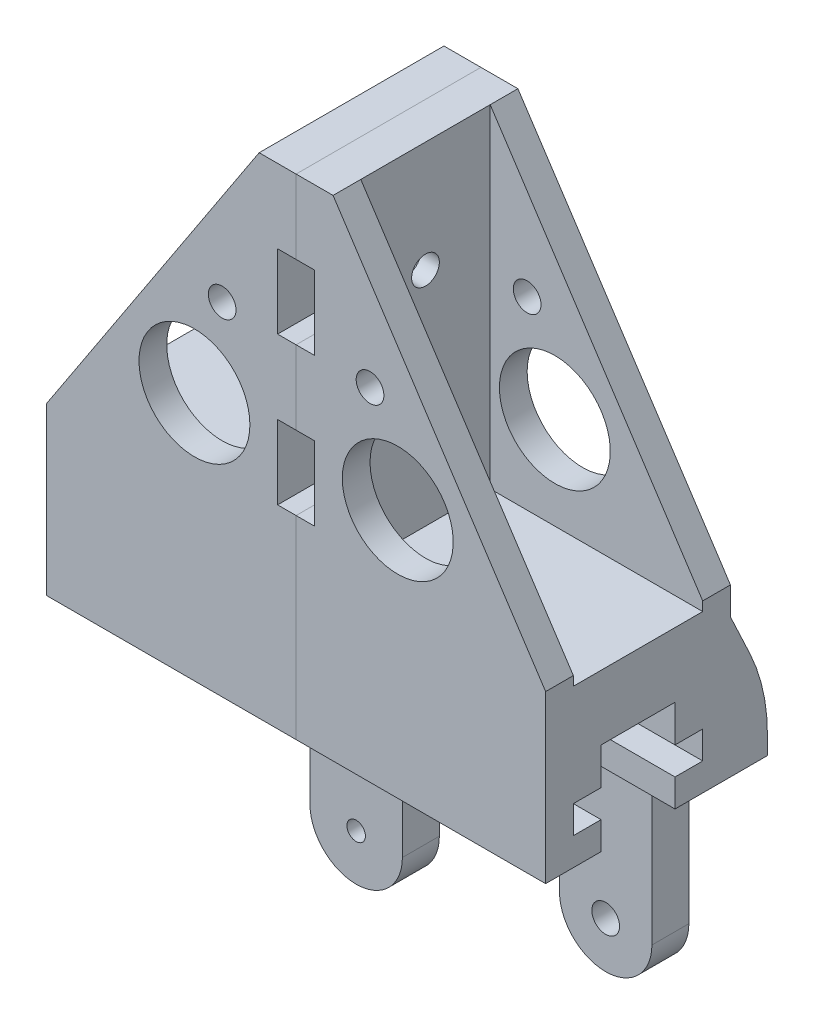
from build123d import *

# Parameters (mm, degrees)
EXTRUDE_1_DEPTH     = 10
SHELL_1_T           = -3
CUT_EXTRUDE_1_DEPTH = 7
SKETCH_3_W          = 2
SKETCH_3_H          = 8
SKETCH_3_H_2        = 6
EXTRUDE_2_DEPTH     = 10
SKETCH_4_R          = 6
SKETCH_4_R_2        = 1.5
CUT_EXTRUDE_2_DEPTH = 20
SKETCH_5_R          = 1.5
CUT_EXTRUDE_3_DEPTH = 20
EXTRUDE_3_DEPTH     = 27
SKETCH_7_R          = 1.5
EXTRUDE_4_DEPTH     = 4
EXTRUDE_5_DEPTH     = 4
SKETCH_9_R          = 1.5
EXTRUDE_6_DEPTH     = 4
SKETCH_10_R         = 1
CUT_EXTRUDE_4_DEPTH = 4


with BuildPart() as part:
    # Sketch 1 → Extrude 1 (new, symmetric)
    with BuildSketch(Plane.XY):
        Polygon((0, 0), (2, 0), (25, -35), (25, -38), (0, -38), align=None)
    extrude(amount=EXTRUDE_1_DEPTH, both=True)

    # Shell 1
    shell_1_openings = [part.faces().sort_by_distance(p)[0] for p in [
        (13.5, -17.5, 0),
    ]]
    offset(amount=SHELL_1_T, openings=shell_1_openings, kind=Kind.INTERSECTION)

    # Sketch 2 → Cut-Extrude 1 (cut, symmetric)
    with BuildSketch(Plane.XY):
        Polygon((2, 0), (2, -36), (25, -36), (25, -35), (22, -30.434782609), (22, -35), (3, -35), (3, -3), (3.971428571, -3), align=None)
    extrude(amount=CUT_EXTRUDE_1_DEPTH, both=True, mode=Mode.SUBTRACT)

    # Sketch 3 → Extrude 2 (add, symmetric)
    with BuildSketch(Plane.XY):
        with Locations((-1, -4)):
            Rectangle(SKETCH_3_W, SKETCH_3_H)
        with Locations((-1, -20)):
            Rectangle(SKETCH_3_W, SKETCH_3_H)
        with Locations((-1, -35)):
            Rectangle(SKETCH_3_W, SKETCH_3_H_2)
    extrude(amount=EXTRUDE_2_DEPTH, both=True)

    # Sketch 4 → Cut-Extrude 2 (cut)
    with BuildSketch(Plane(origin=(0, 0, -10), x_dir=(-1, 0, 0), z_dir=(0, 0, -1))):
        with Locations((-9, -26)):
            Circle(SKETCH_4_R)
        with Locations((-6, -16)):
            Circle(SKETCH_4_R_2)
    extrude(amount=-CUT_EXTRUDE_2_DEPTH, mode=Mode.SUBTRACT)

    # Sketch 5 → Cut-Extrude 3 (cut)
    with BuildSketch(Plane.ZY):
        with Locations((0, -12)):
            Circle(SKETCH_5_R)
        with Locations((0, -28)):
            Circle(SKETCH_5_R)
    extrude(amount=-CUT_EXTRUDE_3_DEPTH, mode=Mode.SUBTRACT)

    # Sketch 6 → Extrude 3 (add)
    with BuildSketch(Plane(origin=(25, 0, 0), x_dir=(0, 0, -1), z_dir=(1, 0, 0))):
        with BuildLine():
            Line((-10, -38), (-10, -53))
            Line((-10, -53), (-4, -53))
            Line((-4, -53), (-4, -50))
            Line((-4, -50), (-7, -50))
            Line((-7, -50), (-7, -47))
            Line((-7, -47), (-4, -47))
            Line((-4, -47), (-4, -43))
            Line((-4, -43), (4, -43))
            Line((4, -43), (4, -47))
            Line((4, -47), (7, -47))
            Line((7, -47), (7, -50))
            Line((7, -50), (4, -50))
            Line((4, -50), (4, -53))
            Line((4, -53), (14, -53))
            Line((14, -53), (14, -51))
            ThreePointArc((14, -51), (13.523741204, -46.661390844), (12.117647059, -42.529411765))
            Line((12.117647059, -42.529411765), (10, -38))
            Line((10, -38), (-10, -38))
        make_face()
    extrude(amount=-EXTRUDE_3_DEPTH)

    # Sketch 7 → Extrude 4 (add)
    with BuildSketch(Plane(origin=(0, 0, -14), x_dir=(-1, 0, 0), z_dir=(0, 0, -1))):
        with BuildLine():
            Line((-6.5, -53), (-6.5, -73))
            ThreePointArc((-6.5, -73), (-11.5, -78), (-16.5, -73))
            Line((-16.5, -73), (-16.5, -53))
            Line((-16.5, -53), (-6.5, -53))
        make_face()
        with Locations(Location((-11.5, -73, 0), (0, 0, 90))):
            Circle(SKETCH_7_R, mode=Mode.SUBTRACT)
    extrude(amount=-EXTRUDE_4_DEPTH)


with BuildPart() as body_2:
    # Mirror 1: mirrored copy
    add(part.part.mirror(Plane(origin=(-2, -32, 10), x_dir=(0, 0, 1), z_dir=(1, 0, 0))))

    # Sketch 8 → Extrude 5 (add)
    with BuildSketch(Plane(origin=(0, 0, -14), x_dir=(-1, 0, 0), z_dir=(0, 0, -1))):
        with BuildLine():
            Line((10.5, -73), (10.5, -78.3))
            ThreePointArc((10.5, -78.3), (15.5, -83.3), (20.5, -78.3))
            Line((20.5, -78.3), (20.5, -73))
            ThreePointArc((20.5, -73), (15.5, -78), (10.5, -73))
        make_face()
    extrude(amount=-EXTRUDE_5_DEPTH)

    # Sketch 9 → Extrude 6 (add)
    with BuildSketch(Plane(origin=(0, 0, -14), x_dir=(-1, 0, 0), z_dir=(0, 0, -1))):
        with Locations((15.5, -73)):
            Circle(SKETCH_9_R)
    extrude(amount=-EXTRUDE_6_DEPTH)

    # Sketch 10 → Cut-Extrude 4 (cut)
    with BuildSketch(Plane(origin=(0, 0, -14), x_dir=(-1, 0, 0), z_dir=(0, 0, -1))):
        with Locations(Location((15.5, -78.3, 0), (0, 0, 90))):
            Circle(SKETCH_10_R)
    extrude(amount=-CUT_EXTRUDE_4_DEPTH, mode=Mode.SUBTRACT)


solid = Compound([part.part, body_2.part])
